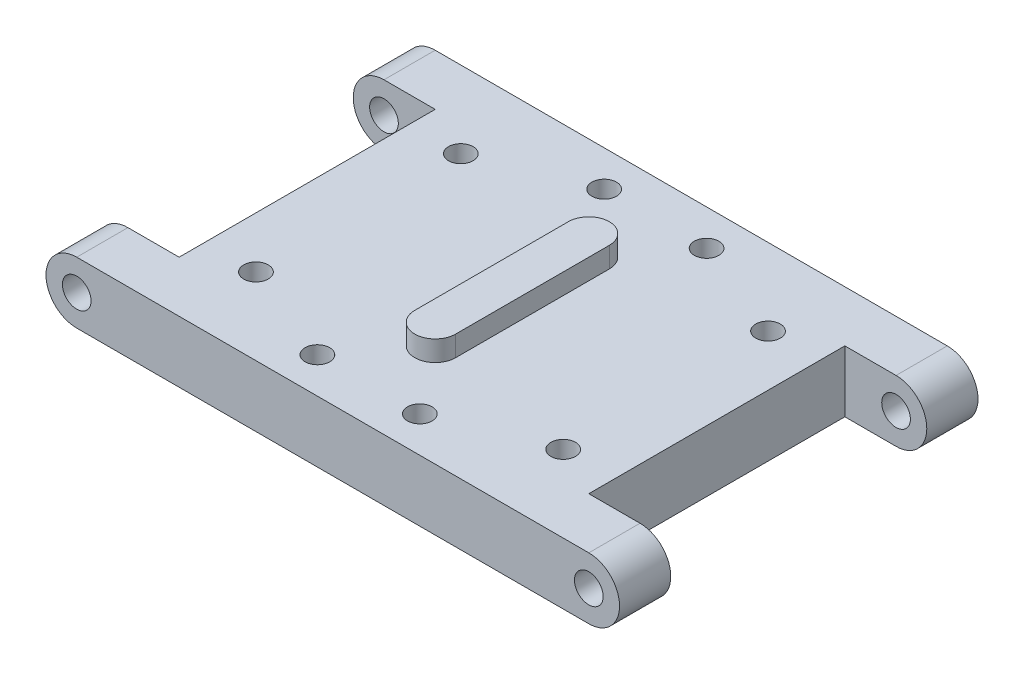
from build123d import *

# Parameters (mm, degrees)
BOSS_EXTRUDE1_DEPTH = 22.225
SKETCH2_W           = 20.32
SKETCH2_H           = 31.75
CUT_EXTRUDE1_DEPTH  = 43.620753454
CUT_EXTRUDE2_DEPTH  = 2.54
SKETCH4_R           = 1.524
CUT_EXTRUDE3_DEPTH  = 43.240627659
SKETCH5_R           = 1.778
CUT_EXTRUDE4_DEPTH  = 58.051136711
BOSS_EXTRUDE2_DEPTH = 2.54
SKETCH7_R           = 1.524
CUT_EXTRUDE5_DEPTH  = 44.147303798


with BuildPart() as part:
    # Sketch1 → Boss-Extrude1 (new, symmetric)
    with BuildSketch(Plane.XY):
        with BuildLine():
            Line((-31.75, 3.81), (31.75, 3.81))
            ThreePointArc((31.75, 3.81), (35.56, 0), (31.75, -3.81))
            Line((31.75, -3.81), (-31.75, -3.81))
            ThreePointArc((-31.75, -3.81), (-35.56, 0), (-31.75, 3.81))
        make_face()
    extrude(amount=BOSS_EXTRUDE1_DEPTH, both=True)

    # Sketch2 → Cut-Extrude1 (cut, through all)
    with BuildSketch(Plane(origin=(0, 3.81, 0), x_dir=(1, 0, 0), z_dir=(0, 1, 0))):
        with Locations((-35.56, 0)):
            Rectangle(SKETCH2_W, SKETCH2_H)
        with Locations((35.56, 0)):
            Rectangle(SKETCH2_W, SKETCH2_H)
    extrude(amount=-CUT_EXTRUDE1_DEPTH, mode=Mode.SUBTRACT)

    # Sketch3 → Cut-Extrude2 (cut)
    with BuildSketch(Plane.XZ.offset(3.81)):
        with BuildLine():
            Line((-6.35, 20.32), (6.35, 20.32))
            ThreePointArc((6.35, 20.32), (8.89, 17.78), (6.35, 15.24))
            Line((6.35, 15.24), (-6.35, 15.24))
            ThreePointArc((-6.35, 15.24), (-8.89, 17.78), (-6.35, 20.32))
        make_face()
        with BuildLine():
            Line((-6.35, -15.24), (6.35, -15.24))
            ThreePointArc((6.35, -15.24), (8.89, -17.78), (6.35, -20.32))
            Line((6.35, -20.32), (-6.35, -20.32))
            ThreePointArc((-6.35, -20.32), (-8.89, -17.78), (-6.35, -15.24))
        make_face()
    extrude(amount=-CUT_EXTRUDE2_DEPTH, mode=Mode.SUBTRACT)

    # Sketch4 → Cut-Extrude3 (cut, through all)
    with BuildSketch(Plane.XZ.offset(1.27)):
        with Locations((-6.35, 17.78)):
            Circle(SKETCH4_R)
        with Locations((6.35, 17.78)):
            Circle(SKETCH4_R)
        with Locations(Location((6.35, -17.78, 0), (0, 0, 180))):
            Circle(SKETCH4_R)
        with Locations(Location((-6.35, -17.78, 0), (0, 0, 180))):
            Circle(SKETCH4_R)
    extrude(amount=-CUT_EXTRUDE3_DEPTH, mode=Mode.SUBTRACT)

    # Sketch5 → Cut-Extrude4 (cut, through all)
    with BuildSketch(Plane.XY.offset(22.225)):
        with Locations((-31.75, 0)):
            Circle(SKETCH5_R)
        with Locations((31.75, 0)):
            Circle(SKETCH5_R)
    extrude(amount=-CUT_EXTRUDE4_DEPTH, mode=Mode.SUBTRACT)

    # Sketch6 → Boss-Extrude2 (add)
    with BuildSketch(Plane(origin=(0, 3.81, 0), x_dir=(1, 0, 0), z_dir=(0, 1, 0))):
        with BuildLine():
            Line((2.54, 9.525), (2.54, -9.525))
            ThreePointArc((2.54, -9.525), (0, -12.065), (-2.54, -9.525))
            Line((-2.54, -9.525), (-2.54, 9.525))
            ThreePointArc((-2.54, 9.525), (0, 12.065), (2.54, 9.525))
        make_face()
    extrude(amount=BOSS_EXTRUDE2_DEPTH)

    # Sketch7 → Cut-Extrude5 (cut, through all)
    with BuildSketch(Plane.XZ.offset(3.81)):
        with Locations((19.05, -12.7)):
            Circle(SKETCH7_R)
        with Locations((19.05, 12.7)):
            Circle(SKETCH7_R)
        with Locations((-19.05, 12.7)):
            Circle(SKETCH7_R)
        with Locations((-19.05, -12.7)):
            Circle(SKETCH7_R)
    extrude(amount=-CUT_EXTRUDE5_DEPTH, mode=Mode.SUBTRACT)


solid = part.part
